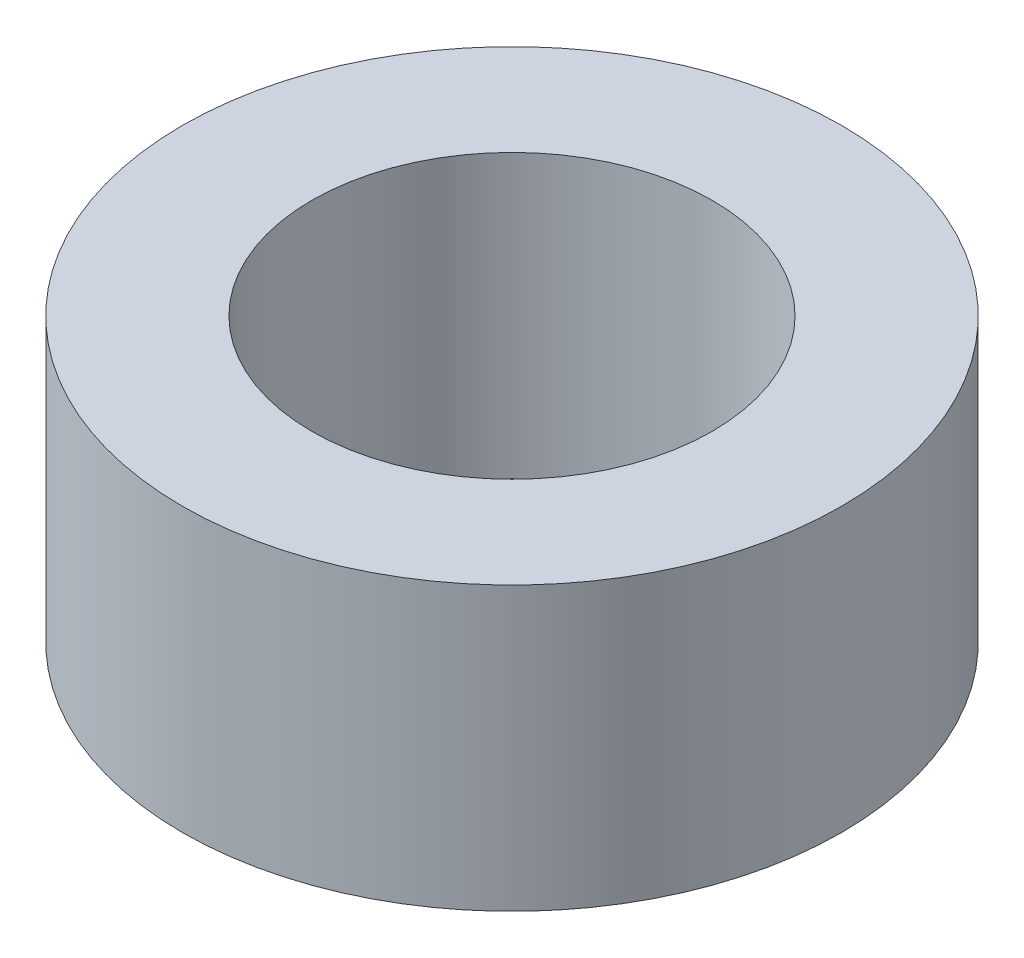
from build123d import *

# Parameters (mm, degrees)
SKETCH1_R           = 3.5
SKETCH1_R_2         = 2.125
BOSS_EXTRUDE1_DEPTH = 3


with BuildPart() as part:
    # Sketch1 → Boss-Extrude1 (new body)
    with BuildSketch(Plane(origin=(0, 0, 0), x_dir=(1, 0, 0), z_dir=(0, 1, 0))):
        with Locations(Location((0, 0, 0), (0, 0, 270))):
            Circle(SKETCH1_R)
        with Locations(Location((0, 0, 0), (0, 0, 270))):
            Circle(SKETCH1_R_2, mode=Mode.SUBTRACT)
    extrude(amount=BOSS_EXTRUDE1_DEPTH)


solid = part.part
